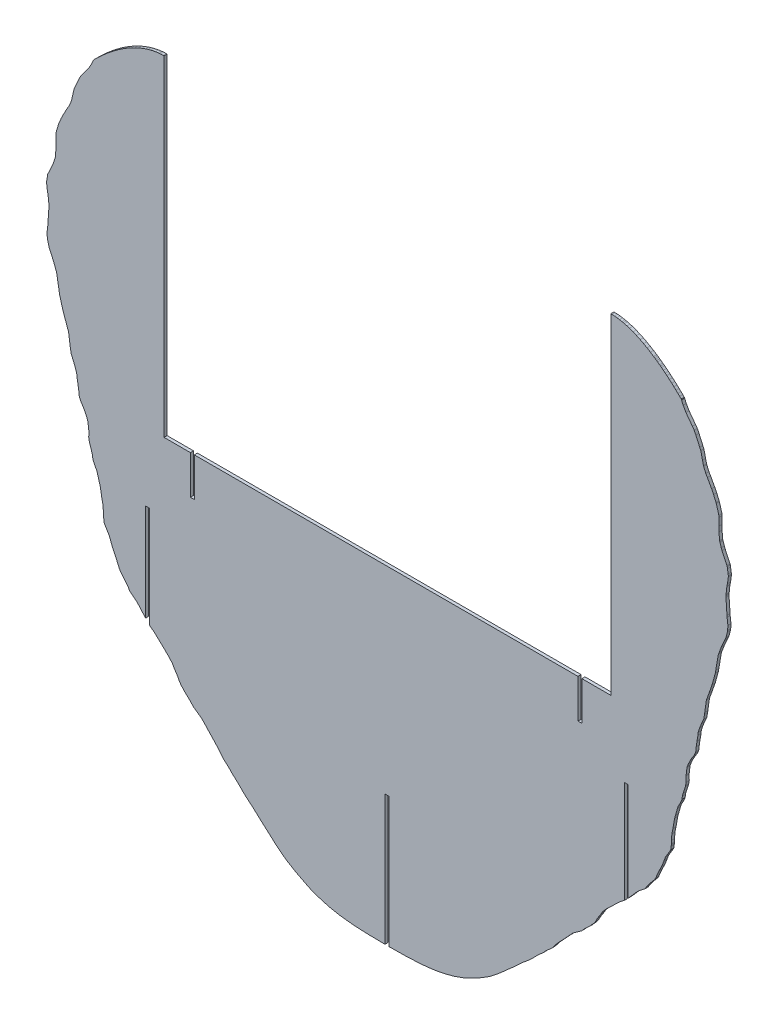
from build123d import *

# Parameters (mm, degrees)
EXTRUDE_1_DEPTH = 2


with BuildPart() as part:
    # Model → Extrude 1 (new body)
    with BuildSketch(Plane.XY):
        Polygon((-5804.3839, 836.0497), (-5806.3839, 836.0497), (-5806.6339, 836.0497), (-5806.6339, 751.7719), (-5816.1644, 751.8978), (-5817.4992, 751.9156), (-5818.2747, 751.9559), (-5819.9537, 752.0402), (-5827.1833, 752.3916), (-5831.1328, 752.8359), (-5835.7292, 753.3756), (-5839.8833, 754.162), (-5842.8779, 754.7578), (-5845.0947, 755.3799), (-5848.0211, 756.1836), (-5851.9979, 757.5583), (-5854.8885, 758.6332), (-5857.0968, 759.7033), (-5864.759, 763.6433), (-5864.8112, 763.6667), (-5864.8634, 763.6902), (-5865.4389, 764.0414), (-5865.5066, 764.0821), (-5865.5742, 764.1228), (-5867.9851, 765.5953), (-5868.5488, 765.9254), (-5868.84, 766.117), (-5870.1496, 766.9162), (-5871.8667, 768.1083), (-5872.1975, 768.3259), (-5872.3023, 768.4107), (-5872.502, 768.5493), (-5873.6049, 769.4641), (-5875.7124, 771.1686), (-5878.1362, 773.0993), (-5879.0312, 773.9723), (-5879.8545, 774.6457), (-5881.0854, 775.8036), (-5885.8632, 779.979), (-5889.2742, 783.1358), (-5891.3116, 784.9701), (-5892.251, 785.8635), (-5892.3363, 785.9508), (-5892.4215, 786.0381), (-5892.837, 786.3891), (-5893.2186, 786.6587), (-5894.3658, 787.6205), (-5896.5748, 789.4812), (-5899.043, 791.8233), (-5901.8105, 794.6416), (-5903.8277, 796.489), (-5906.0865, 798.4934), (-5907.1466, 799.7697), (-5908.1051, 800.6457), (-5911.608, 803.7685), (-5914.2929, 807.2329), (-5914.9074, 807.9869), (-5924.3994, 818.1354), (-5924.7504, 818.5365), (-5924.8501, 818.6284), (-5924.9498, 818.7204), (-5925.0399, 818.8009), (-5925.13, 818.8814), (-5927.2887, 820.5208), (-5930.7649, 822.9693), (-5932.802, 825.2003), (-5933.9845, 826.4205), (-5935.7843, 827.9636), (-5936.8795, 829.2522), (-5937.7341, 830.2104), (-5938.3908, 830.8222), (-5938.6587, 831.1763), (-5939.4693, 832.2202), (-5941.3494, 835.6981), (-5943.388, 838.7749), (-5944.0977, 840.1051), (-5944.212, 840.3138), (-5944.3263, 840.5225), (-5945.4997, 841.8494), (-5947.0465, 843.5373), (-5947.1959, 843.6832), (-5953.2154, 849.4644), (-5955.8353, 851.9385), (-5956.4874, 852.4492), (-5958.6224, 854.0276), (-5959.1338, 854.482), (-5959.1338, 920.079), (-5959.3839, 920.079), (-5961.3839, 920.079), (-5961.6338, 920.079), (-5961.6338, 857.184), (-5964.966, 860.9151), (-5966.7855, 863.0199), (-5968.0384, 864.1402), (-5971.9293, 867.2232), (-5972.0501, 867.4447), (-5972.1709, 867.6662), (-5972.774, 868.7467), (-5974.7782, 871.3066), (-5974.9323, 871.5767), (-5975.0864, 871.8468), (-5975.8134, 872.6961), (-5978.0533, 875.3468), (-5978.7387, 876.5985), (-5980.8785, 881.6838), (-5980.9926, 881.8731), (-5981.1067, 882.0625), (-5982.643, 885.1963), (-5983.9639, 888.4629), (-5984.2915, 889.5132), (-5985.1196, 891.5619), (-5985.6036, 892.4184), (-5987.355, 895.3535), (-5988.2102, 896.7719), (-5988.442, 897.175), (-5988.4738, 897.3949), (-5988.7135, 899.2955), (-5988.7262, 899.3572), (-5988.7388, 899.4189), (-5988.8459, 900.1889), (-5988.8464, 900.2457), (-5988.8469, 900.3025), (-5988.9215, 900.6902), (-5988.9959, 901.078), (-5988.9859, 902.8461), (-5989.1853, 906.5229), (-5989.9012, 909.8884), (-5990.9936, 916.2501), (-5991.5211, 918.0653), (-5992.83, 922.7678), (-5993.252, 924.0637), (-5994.1601, 925.7245), (-5995.1207, 927.6513), (-5995.8326, 929.2669), (-5995.9583, 931.067), (-5996.5013, 932.9513), (-5998.0129, 937.6749), (-5998.0847, 938.1014), (-5998.4743, 940.2265), (-5998.4124, 943.7055), (-5998.4296, 944.146), (-5998.9917, 948.6151), (-5999.1586, 949.3263), (-5999.83, 951.0285), (-6001.0629, 953.631), (-6002.2515, 955.7358), (-6003.6462, 957.8541), (-6004.3385, 959.4092), (-6004.6578, 960.4184), (-6004.9614, 963.3342), (-6005.453, 966.6202), (-6005.4643, 966.6896), (-6005.4755, 966.7589), (-6006.1374, 970.4479), (-6006.2382, 971.868), (-6006.2708, 972.0867), (-6007.2003, 974.9839), (-6008.3074, 977.884), (-6009.8059, 981.2033), (-6010.3632, 984.2243), (-6010.4328, 984.77), (-6010.5025, 985.3157), (-6011.5455, 992.776), (-6013.3448, 997.7876), (-6015.258, 1003.2142), (-6017.3245, 1010.7463), (-6017.3444, 1010.8489), (-6017.3643, 1010.9514), (-6017.6275, 1012.5505), (-6019.3031, 1022.4056), (-6019.9412, 1023.8694), (-6021.1501, 1027.2933), (-6023.4014, 1032.1994), (-6024.0142, 1033.546), (-6024.2282, 1034.1694), (-6025.2233, 1038.1004), (-6025.269, 1038.4718), (-6025.3148, 1038.8431), (-6025.4861, 1041.5935), (-6024.9598, 1045.8597), (-6024.8884, 1047.014), (-6024.2263, 1056.8146), (-6024.1768, 1057.4505), (-6024.1836, 1057.5831), (-6024.1903, 1057.7154), (-6024.3245, 1058.516), (-6024.8177, 1063.1317), (-6025.2345, 1064.9608), (-6025.7636, 1069.0267), (-6025.7849, 1069.1886), (-6025.8062, 1069.3504), (-6025.8044, 1069.4669), (-6025.7945, 1069.5785), (-6025.7846, 1069.69), (-6025.6458, 1070.5899), (-6025.2242, 1073.3153), (-6025.0565, 1074.347), (-6025.0275, 1074.4322), (-6024.9987, 1074.5174), (-6024.8829, 1074.7634), (-6024.7672, 1075.0094), (-6021.7061, 1081.6551), (-6021.1853, 1083.0296), (-6020.3734, 1085.5169), (-6020.1867, 1085.9986), (-6020.0859, 1086.5262), (-6019.7193, 1091.2474), (-6019.676, 1094.4), (-6019.7209, 1099.3265), (-6019.6312, 1100.5154), (-6017.9762, 1106.2511), (-6017.8916, 1106.4439), (-6017.807, 1106.6369), (-6016.2192, 1110.3697), (-6014.9184, 1113.0326), (-6012.2263, 1117.9522), (-6011.1822, 1119.7015), (-6009.7951, 1123.0426), (-6009.6511, 1123.3592), (-6009.0478, 1126.0429), (-6007.9239, 1130.9686), (-6007.26, 1132.398), (-6004.7557, 1138.0055), (-6003.6607, 1140.2436), (-6002.5034, 1141.855), (-5998.3656, 1147.4083), (-5996.5661, 1150.6158), (-5995.5018, 1152.9276), (-5995.435, 1153.0099), (-5995.2473, 1153.5038), (-5994.2278, 1154.5143), (-5993.1001, 1155.6102), (-5991.8687, 1156.7803), (-5990.5382, 1158.0133), (-5989.1133, 1159.2981), (-5987.5984, 1160.6231), (-5985.9981, 1161.9774), (-5984.8659, 1162.9073), (-5983.6978, 1163.8418), (-5982.4954, 1164.7773), (-5981.8778, 1165.244), (-5981.2601, 1165.7105), (-5979.9932, 1166.6378), (-5979.3448, 1167.0968), (-5978.6964, 1167.5559), (-5978.0336, 1168.0084), (-5977.3709, 1168.4608), (-5975.2792, 1169.8194), (-5973.1284, 1171.1263), (-5970.9235, 1172.3683), (-5968.67, 1173.5328), (-5966.3729, 1174.6068), (-5964.0374, 1175.5777), (-5961.6688, 1176.4325), (-5960.0828, 1176.9288), (-5958.4856, 1177.3651), (-5956.8786, 1177.7374), (-5955.2639, 1178.0416), (-5953.6431, 1178.2743), (-5952.8305, 1178.3529), (-5952.0179, 1178.4316), (-5950.39, 1178.5095), (-5950.0315, 1178.5128), (-5949.6728, 1178.516), (-5949.6728, 964.5249), (-5932.6339, 964.5249), (-5932.6339, 939.4676), (-5932.3839, 939.4676), (-5930.3839, 939.4676), (-5930.1339, 939.4676), (-5930.1339, 964.5249), (-5681.634, 964.5249), (-5681.634, 939.4676), (-5681.3839, 939.4676), (-5679.3839, 939.4676), (-5679.134, 939.4676), (-5679.134, 964.5249), (-5660.3839, 964.5249), (-5660.3839, 1178.516), (-5659.6697, 1178.5096), (-5658.0416, 1178.4317), (-5656.4159, 1178.2745), (-5655.6052, 1178.1581), (-5654.7945, 1178.0417), (-5653.1792, 1177.7373), (-5652.3754, 1177.5511), (-5651.5717, 1177.3651), (-5649.9739, 1176.9288), (-5648.3878, 1176.4325), (-5646.0192, 1175.5777), (-5643.6836, 1174.607), (-5641.3866, 1173.5328), (-5639.133, 1172.3683), (-5636.9283, 1171.1261), (-5634.7774, 1169.8194), (-5632.6858, 1168.4608), (-5632.023, 1168.0084), (-5631.3602, 1167.5559), (-5630.7117, 1167.097), (-5630.0633, 1166.638), (-5628.7965, 1165.7105), (-5628.1789, 1165.244), (-5627.5612, 1164.7773), (-5626.3588, 1163.8417), (-5625.1908, 1162.9072), (-5624.0585, 1161.9774), (-5622.4581, 1160.6234), (-5620.9433, 1159.2981), (-5619.5184, 1158.0133), (-5618.1879, 1156.7803), (-5616.9566, 1155.6101), (-5615.8288, 1154.5143), (-5614.8093, 1153.5038), (-5614.6216, 1153.0099), (-5614.5549, 1152.9276), (-5613.4905, 1150.6158), (-5611.6911, 1147.4083), (-5607.5533, 1141.855), (-5606.396, 1140.2436), (-5605.301, 1138.0055), (-5602.7967, 1132.398), (-5602.1327, 1130.9686), (-5601.0087, 1126.0429), (-5600.4056, 1123.3592), (-5600.2615, 1123.0426), (-5598.8744, 1119.7015), (-5597.8303, 1117.9522), (-5595.1382, 1113.0326), (-5593.8374, 1110.3697), (-5592.2496, 1106.6369), (-5592.1651, 1106.4439), (-5592.0805, 1106.2511), (-5590.4255, 1100.5154), (-5590.3357, 1099.3265), (-5590.3807, 1094.4), (-5590.3373, 1091.2474), (-5589.9707, 1086.5262), (-5589.8699, 1085.9986), (-5589.6832, 1085.5169), (-5588.8714, 1083.0296), (-5588.3504, 1081.6551), (-5585.2895, 1075.0094), (-5585.0579, 1074.5174), (-5585.0002, 1074.347), (-5584.8324, 1073.3153), (-5584.4108, 1070.5899), (-5584.2755, 1069.7269), (-5584.2523, 1069.4669), (-5584.2504, 1069.3553), (-5584.293, 1069.0267), (-5584.8222, 1064.9608), (-5585.239, 1063.1317), (-5585.7322, 1058.516), (-5585.8663, 1057.7154), (-5585.8798, 1057.4505), (-5585.8303, 1056.8146), (-5585.1682, 1047.014), (-5585.0969, 1045.8597), (-5584.5705, 1041.5935), (-5584.7419, 1038.8431), (-5584.8333, 1038.1004), (-5585.8284, 1034.1694), (-5586.0424, 1033.546), (-5586.6552, 1032.1994), (-5588.9065, 1027.2933), (-5590.1154, 1023.8694), (-5590.7536, 1022.4056), (-5592.4292, 1012.5505), (-5592.6923, 1010.9514), (-5592.7321, 1010.7463), (-5594.7986, 1003.2142), (-5596.7119, 997.7876), (-5598.5111, 992.776), (-5599.5541, 985.3157), (-5599.6934, 984.2243), (-5600.2508, 981.2033), (-5601.7492, 977.884), (-5602.8563, 974.9839), (-5603.7844, 972.0929), (-5603.8184, 971.868), (-5603.9193, 970.4479), (-5604.5811, 966.7589), (-5604.6036, 966.6202), (-5605.0953, 963.3342), (-5605.3988, 960.4184), (-5605.7182, 959.4092), (-5606.4105, 957.8541), (-5607.8051, 955.7358), (-5608.9937, 953.631), (-5610.2265, 951.0285), (-5610.898, 949.3263), (-5611.065, 948.6151), (-5611.627, 944.146), (-5611.6442, 943.7055), (-5611.5824, 940.2265), (-5611.9719, 938.1014), (-5612.0437, 937.6749), (-5613.5554, 932.9513), (-5614.0983, 931.067), (-5614.2241, 929.2669), (-5614.9359, 927.6513), (-5615.8965, 925.7245), (-5616.8046, 924.0637), (-5617.2266, 922.7678), (-5618.5355, 918.0653), (-5619.0631, 916.2501), (-5620.1554, 909.8884), (-5620.8714, 906.5229), (-5621.0707, 902.8461), (-5621.0607, 901.078), (-5621.2097, 900.3025), (-5621.2108, 900.1889), (-5621.3177, 899.4189), (-5621.3432, 899.2955), (-5621.5828, 897.3949), (-5621.6147, 897.175), (-5621.8465, 896.7719), (-5622.7016, 895.3535), (-5624.4531, 892.4184), (-5624.937, 891.5619), (-5625.7652, 889.5132), (-5626.0927, 888.4629), (-5627.4136, 885.1963), (-5628.95, 882.0625), (-5629.1781, 881.6838), (-5631.318, 876.5985), (-5632.0033, 875.3468), (-5634.2433, 872.6961), (-5634.9702, 871.8468), (-5635.2785, 871.3066), (-5637.2826, 868.7467), (-5637.8858, 867.6662), (-5638.1093, 867.2453), (-5642.0182, 864.1402), (-5643.2712, 863.0199), (-5645.0907, 860.9151), (-5649.1339, 856.3877), (-5649.1339, 920.079), (-5649.3839, 920.079), (-5651.3839, 920.079), (-5651.6339, 920.079), (-5651.6339, 853.88), (-5653.5692, 852.4492), (-5654.2213, 851.9385), (-5656.8412, 849.4644), (-5662.8607, 843.6832), (-5663.0102, 843.5373), (-5664.5569, 841.8494), (-5665.7303, 840.5225), (-5665.8446, 840.3138), (-5665.9589, 840.1051), (-5666.6686, 838.7749), (-5668.7072, 835.6981), (-5670.5873, 832.2202), (-5671.3979, 831.1763), (-5671.5319, 830.9992), (-5671.6658, 830.8222), (-5672.3226, 830.2104), (-5673.1771, 829.2522), (-5674.2724, 827.9636), (-5676.0722, 826.4205), (-5677.2547, 825.2003), (-5679.2918, 822.9693), (-5682.768, 820.5208), (-5684.9266, 818.8814), (-5685.0167, 818.8009), (-5685.1069, 818.7204), (-5685.2065, 818.6284), (-5685.3062, 818.5365), (-5685.6572, 818.1354), (-5695.1492, 807.9869), (-5695.7638, 807.2329), (-5698.4487, 803.7685), (-5701.9515, 800.6457), (-5702.91, 799.7697), (-5703.9701, 798.4934), (-5706.2289, 796.489), (-5708.2461, 794.6416), (-5711.0136, 791.8233), (-5713.4818, 789.4812), (-5715.6908, 787.6205), (-5716.8381, 786.6587), (-5717.2196, 786.3891), (-5717.6351, 786.0381), (-5717.7204, 785.9508), (-5717.8057, 785.8635), (-5718.745, 784.9701), (-5720.7825, 783.1358), (-5724.1934, 779.979), (-5728.9712, 775.8036), (-5730.2022, 774.6457), (-5731.0254, 773.9723), (-5731.9204, 773.0993), (-5734.3443, 771.1686), (-5736.4517, 769.4641), (-5737.5546, 768.5493), (-5737.6544, 768.48), (-5737.7543, 768.4107), (-5737.8067, 768.3683), (-5737.8592, 768.3259), (-5738.19, 768.1083), (-5739.907, 766.9162), (-5741.2166, 766.117), (-5741.5079, 765.9254), (-5742.0715, 765.5953), (-5744.4824, 764.1228), (-5744.6177, 764.0414), (-5745.1933, 763.6902), (-5745.2454, 763.6667), (-5745.2976, 763.6433), (-5752.9599, 759.7033), (-5755.1681, 758.6332), (-5758.0587, 757.5583), (-5762.0356, 756.1836), (-5764.962, 755.3799), (-5767.1788, 754.7578), (-5770.1734, 754.162), (-5774.3274, 753.3756), (-5778.9239, 752.8359), (-5782.8733, 752.3916), (-5790.1029, 752.0402), (-5791.7819, 751.9559), (-5792.5574, 751.9156), (-5793.8922, 751.8978), (-5804.1339, 751.7623), (-5804.1339, 836.0497), align=None)
    extrude(amount=EXTRUDE_1_DEPTH)


solid = part.part
